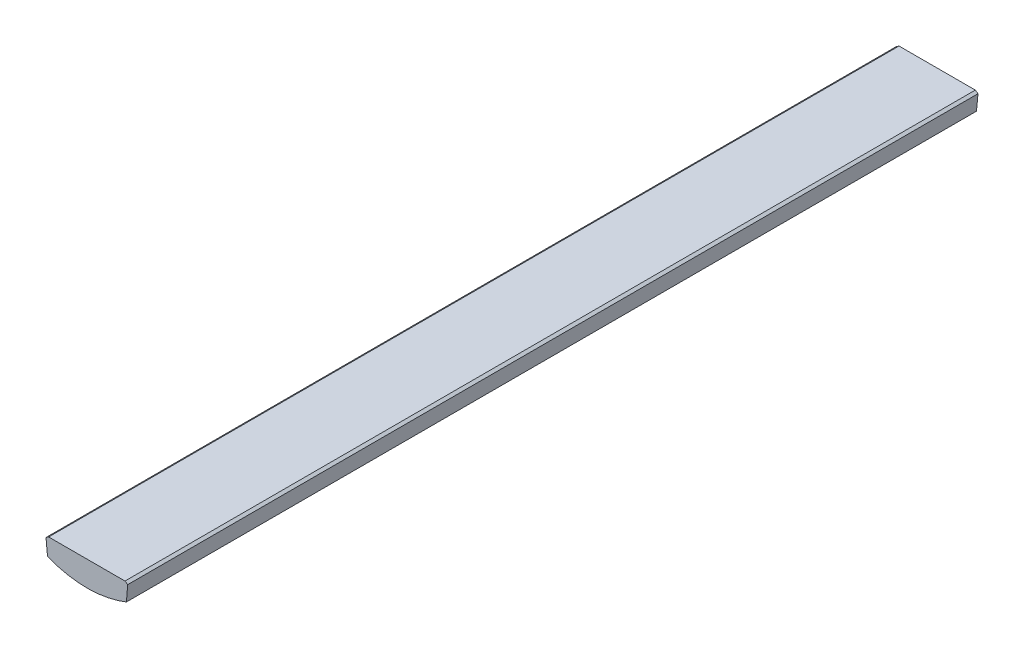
ISO-10303-21;
HEADER;
FILE_DESCRIPTION(('STEP AP214'),'2;1');
FILE_NAME('part.step','',(''),(''),'','','');
FILE_SCHEMA(('AUTOMOTIVE_DESIGN { 1 0 10303 214 1 1 1 1 }'));
ENDSEC;
DATA;
#1=APPLICATION_CONTEXT('core data for automotive mechanical design processes');
#2=APPLICATION_PROTOCOL_DEFINITION('international standard','automotive_design',2000,#1);
#3=PRODUCT_CONTEXT('',#1,'mechanical');
#4=PRODUCT('Part','Part','',(#3));
#5=PRODUCT_RELATED_PRODUCT_CATEGORY('part','',(#4));
#6=PRODUCT_DEFINITION_FORMATION('','',#4);
#7=PRODUCT_DEFINITION_CONTEXT('part definition',#1,'design');
#8=PRODUCT_DEFINITION('design','',#6,#7);
#9=PRODUCT_DEFINITION_SHAPE('','',#8);
#10=(LENGTH_UNIT() NAMED_UNIT(*) SI_UNIT(.MILLI.,.METRE.));
#11=(NAMED_UNIT(*) PLANE_ANGLE_UNIT() SI_UNIT($,.RADIAN.));
#12=(NAMED_UNIT(*) SI_UNIT($,.STERADIAN.) SOLID_ANGLE_UNIT());
#13=UNCERTAINTY_MEASURE_WITH_UNIT(LENGTH_MEASURE(1.E-05),#10,'distance_accuracy_value','');
#14=(GEOMETRIC_REPRESENTATION_CONTEXT(3) GLOBAL_UNCERTAINTY_ASSIGNED_CONTEXT((#13)) GLOBAL_UNIT_ASSIGNED_CONTEXT((#10,
#11,#12)) REPRESENTATION_CONTEXT('',''));
#15=CARTESIAN_POINT('',(0.,0.,0.));
#16=DIRECTION('',(0.,0.,1.));
#17=DIRECTION('',(1.,0.,0.));
#18=AXIS2_PLACEMENT_3D('',#15,#16,#17);
#19=CARTESIAN_POINT('',(-15.51625609,2.71949604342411E-13,186.04342008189));
#20=DIRECTION('',(0.,0.00872653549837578,-0.999961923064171));
#21=DIRECTION('',(-1.,0.,0.));
#22=AXIS2_PLACEMENT_3D('',#19,#20,#21);
#23=PLANE('',#22);
#24=DIRECTION('',(-0.830448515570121,-0.557074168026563,-0.00486151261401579));
#25=VECTOR('',#24,1.);
#26=CARTESIAN_POINT('',(-15.805216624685,-0.87758187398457,186.0357615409));
#27=LINE('',#26,#25);
#28=CARTESIAN_POINT('',(-14.49697688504,2.71949604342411E-13,186.04342008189));
#29=VERTEX_POINT('',#28);
#30=CARTESIAN_POINT('',(-15.51625609,-0.68374391,186.037453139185));
#31=VERTEX_POINT('',#30);
#32=EDGE_CURVE('E111',#29,#31,#27,.T.);
#33=ORIENTED_EDGE('',*,*,#32,.T.);
#34=DIRECTION('',(0.0871524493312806,-0.996157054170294,-0.00869333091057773));
#35=VECTOR('',#34,1.);
#36=CARTESIAN_POINT('',(-15.2707507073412,-3.48988327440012,186.012964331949));
#37=LINE('',#36,#35);
#38=CARTESIAN_POINT('',(-14.991795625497,-6.67835445,185.985138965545));
#39=VERTEX_POINT('',#38);
#40=EDGE_CURVE('E126',#31,#39,#37,.T.);
#41=ORIENTED_EDGE('',*,*,#40,.T.);
#42=CARTESIAN_POINT('',(-14.991795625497,-6.67835445,185.985138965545));
#43=CARTESIAN_POINT('',(-5.25356828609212,-10.6238388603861,185.950707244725));
#44=CARTESIAN_POINT('',(5.25356828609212,-10.6238388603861,185.950707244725));
#45=CARTESIAN_POINT('',(14.991795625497,-6.67835445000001,185.985138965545));
#46=(BOUNDED_CURVE() B_SPLINE_CURVE(3,(#42,#43,#44,#45),.UNSPECIFIED.,.F.,
.F.) B_SPLINE_CURVE_WITH_KNOTS((4,4),(2.75665085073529,3.5265344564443),
.UNSPECIFIED.) CURVE() GEOMETRIC_REPRESENTATION_ITEM() RATIONAL_B_SPLINE_CURVE((1.,
0.951213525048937,0.951213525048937,1.)) REPRESENTATION_ITEM(''));
#47=CARTESIAN_POINT('',(14.991795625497,-6.67835445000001,185.985138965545));
#48=VERTEX_POINT('',#47);
#49=EDGE_CURVE('E142',#39,#48,#46,.T.);
#50=ORIENTED_EDGE('',*,*,#49,.T.);
#51=DIRECTION('',(0.0871524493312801,0.996157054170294,0.00869333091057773));
#52=VECTOR('',#51,1.);
#53=CARTESIAN_POINT('',(15.2707507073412,-3.48988327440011,186.012964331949));
#54=LINE('',#53,#52);
#55=CARTESIAN_POINT('',(15.51625609,-0.683743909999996,186.037453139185));
#56=VERTEX_POINT('',#55);
#57=EDGE_CURVE('E152',#48,#56,#54,.T.);
#58=ORIENTED_EDGE('',*,*,#57,.T.);
#59=DIRECTION('',(-0.830448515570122,0.55707416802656,0.00486151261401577));
#60=VECTOR('',#59,1.);
#61=CARTESIAN_POINT('',(15.805216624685,-0.877581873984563,186.035761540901));
#62=LINE('',#61,#60);
#63=CARTESIAN_POINT('',(14.49697688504,3.117506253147E-13,186.04342008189));
#64=VERTEX_POINT('',#63);
#65=EDGE_CURVE('E108',#56,#64,#62,.T.);
#66=ORIENTED_EDGE('',*,*,#65,.T.);
#67=DIRECTION('',(-1.,0.,0.));
#68=VECTOR('',#67,1.);
#69=CARTESIAN_POINT('',(14.49697688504,0.,186.04342008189));
#70=LINE('',#69,#68);
#71=EDGE_CURVE('E26',#64,#29,#70,.T.);
#72=ORIENTED_EDGE('',*,*,#71,.T.);
#73=EDGE_LOOP('',(#33,#41,#50,#58,#66,#72));
#74=FACE_BOUND('',#73,.T.);
#75=ADVANCED_FACE('F16',(#74),#23,.F.);
#76=CARTESIAN_POINT('',(-15.51625609,3.11516330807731E-13,-137.04342008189));
#77=DIRECTION('',(0.,0.00872653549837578,0.999961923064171));
#78=DIRECTION('',(1.,0.,0.));
#79=AXIS2_PLACEMENT_3D('',#76,#77,#78);
#80=PLANE('',#79);
#81=DIRECTION('',(0.830448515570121,0.557074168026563,-0.00486151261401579));
#82=VECTOR('',#81,1.);
#83=CARTESIAN_POINT('',(-14.4931149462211,0.00259063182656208,-137.043442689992));
#84=LINE('',#83,#82);
#85=CARTESIAN_POINT('',(-15.51625609,-0.68374391,-137.037453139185));
#86=VERTEX_POINT('',#85);
#87=CARTESIAN_POINT('',(-14.49697688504,3.117506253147E-13,-137.04342008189));
#88=VERTEX_POINT('',#87);
#89=EDGE_CURVE('E101',#86,#88,#84,.T.);
#90=ORIENTED_EDGE('',*,*,#89,.T.);
#91=DIRECTION('',(1.,0.,0.));
#92=VECTOR('',#91,1.);
#93=CARTESIAN_POINT('',(14.49697688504,0.,-137.04342008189));
#94=LINE('',#93,#92);
#95=CARTESIAN_POINT('',(14.49697688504,3.11516330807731E-13,-137.04342008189));
#96=VERTEX_POINT('',#95);
#97=EDGE_CURVE('E10',#88,#96,#94,.T.);
#98=ORIENTED_EDGE('',*,*,#97,.T.);
#99=DIRECTION('',(0.830448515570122,-0.55707416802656,0.00486151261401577));
#100=VECTOR('',#99,1.);
#101=CARTESIAN_POINT('',(14.4931149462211,0.00259063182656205,-137.043442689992));
#102=LINE('',#101,#100);
#103=CARTESIAN_POINT('',(15.51625609,-0.683743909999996,-137.037453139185));
#104=VERTEX_POINT('',#103);
#105=EDGE_CURVE('E55',#96,#104,#102,.T.);
#106=ORIENTED_EDGE('',*,*,#105,.T.);
#107=DIRECTION('',(-0.0871524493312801,-0.996157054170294,0.00869333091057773));
#108=VECTOR('',#107,1.);
#109=CARTESIAN_POINT('',(15.516985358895,-0.675408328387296,-137.037525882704));
#110=LINE('',#109,#108);
#111=CARTESIAN_POINT('',(14.991795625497,-6.67835445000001,-136.985138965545));
#112=VERTEX_POINT('',#111);
#113=EDGE_CURVE('E144',#104,#112,#110,.T.);
#114=ORIENTED_EDGE('',*,*,#113,.T.);
#115=CARTESIAN_POINT('',(14.991795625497,-6.67835445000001,-136.985138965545));
#116=CARTESIAN_POINT('',(5.25356828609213,-10.6238388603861,-136.950707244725));
#117=CARTESIAN_POINT('',(-5.25356828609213,-10.6238388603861,-136.950707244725));
#118=CARTESIAN_POINT('',(-14.991795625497,-6.67835445,-136.985138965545));
#119=(BOUNDED_CURVE() B_SPLINE_CURVE(3,(#115,#116,#117,#118),.UNSPECIFIED.,.F.,
.F.) B_SPLINE_CURVE_WITH_KNOTS((4,4),(5.89824350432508,6.66812711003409),
.UNSPECIFIED.) CURVE() GEOMETRIC_REPRESENTATION_ITEM() RATIONAL_B_SPLINE_CURVE((1.,
0.951213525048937,0.951213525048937,1.)) REPRESENTATION_ITEM(''));
#120=CARTESIAN_POINT('',(-14.991795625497,-6.67835445,-136.985138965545));
#121=VERTEX_POINT('',#120);
#122=EDGE_CURVE('E68',#112,#121,#119,.T.);
#123=ORIENTED_EDGE('',*,*,#122,.T.);
#124=DIRECTION('',(-0.0871524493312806,0.996157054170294,-0.00869333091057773));
#125=VECTOR('',#124,1.);
#126=CARTESIAN_POINT('',(-15.516985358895,-0.6754083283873,-137.037525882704));
#127=LINE('',#126,#125);
#128=EDGE_CURVE('E103',#121,#86,#127,.T.);
#129=ORIENTED_EDGE('',*,*,#128,.T.);
#130=EDGE_LOOP('',(#90,#98,#106,#114,#123,#129));
#131=FACE_BOUND('',#130,.T.);
#132=ADVANCED_FACE('F102',(#131),#80,.F.);
#133=CARTESIAN_POINT('',(14.49697688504,0.,0.));
#134=DIRECTION('',(0.,1.,0.));
#135=DIRECTION('',(1.,0.,0.));
#136=AXIS2_PLACEMENT_3D('',#133,#134,#135);
#137=PLANE('',#136);
#138=ORIENTED_EDGE('',*,*,#71,.F.);
#139=DIRECTION('',(0.,0.,1.));
#140=VECTOR('',#139,1.);
#141=CARTESIAN_POINT('',(14.49697688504,3.117506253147E-13,-135.));
#142=LINE('',#141,#140);
#143=EDGE_CURVE('E99',#96,#64,#142,.T.);
#144=ORIENTED_EDGE('',*,*,#143,.F.);
#145=ORIENTED_EDGE('',*,*,#97,.F.);
#146=DIRECTION('',(0.,0.,1.));
#147=VECTOR('',#146,1.);
#148=CARTESIAN_POINT('',(-14.49697688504,3.117506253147E-13,-135.));
#149=LINE('',#148,#147);
#150=EDGE_CURVE('E19',#88,#29,#149,.T.);
#151=ORIENTED_EDGE('',*,*,#150,.T.);
#152=EDGE_LOOP('',(#138,#144,#145,#151));
#153=FACE_BOUND('',#152,.T.);
#154=ADVANCED_FACE('F95',(#153),#137,.T.);
#155=CARTESIAN_POINT('',(14.49697688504,3.117506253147E-13,-138.));
#156=DIRECTION('',(0.55708075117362,0.830458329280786,0.));
#157=DIRECTION('',(0.,0.,-1.));
#158=AXIS2_PLACEMENT_3D('',#155,#156,#157);
#159=PLANE('',#158);
#160=ORIENTED_EDGE('',*,*,#65,.F.);
#161=DIRECTION('',(0.,0.,1.));
#162=VECTOR('',#161,1.);
#163=CARTESIAN_POINT('',(15.51625609,-0.683743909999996,-138.));
#164=LINE('',#163,#162);
#165=EDGE_CURVE('E147',#104,#56,#164,.T.);
#166=ORIENTED_EDGE('',*,*,#165,.F.);
#167=ORIENTED_EDGE('',*,*,#105,.F.);
#168=ORIENTED_EDGE('',*,*,#143,.T.);
#169=EDGE_LOOP('',(#160,#166,#167,#168));
#170=FACE_BOUND('',#169,.T.);
#171=ADVANCED_FACE('F168',(#170),#159,.T.);
#172=CARTESIAN_POINT('',(-14.49697688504,3.117506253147E-13,-138.));
#173=DIRECTION('',(-0.557080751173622,0.830458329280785,0.));
#174=DIRECTION('',(0.,0.,1.));
#175=AXIS2_PLACEMENT_3D('',#172,#173,#174);
#176=PLANE('',#175);
#177=ORIENTED_EDGE('',*,*,#32,.F.);
#178=ORIENTED_EDGE('',*,*,#150,.F.);
#179=ORIENTED_EDGE('',*,*,#89,.F.);
#180=DIRECTION('',(0.,0.,1.));
#181=VECTOR('',#180,1.);
#182=CARTESIAN_POINT('',(-15.51625609,-0.68374391,-138.));
#183=LINE('',#182,#181);
#184=EDGE_CURVE('E122',#86,#31,#183,.T.);
#185=ORIENTED_EDGE('',*,*,#184,.T.);
#186=EDGE_LOOP('',(#177,#178,#179,#185));
#187=FACE_BOUND('',#186,.T.);
#188=ADVANCED_FACE('F110',(#187),#176,.T.);
#189=CARTESIAN_POINT('',(-15.51625609,-0.68374391,-138.));
#190=DIRECTION('',(-0.996194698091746,-0.0871557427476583,0.));
#191=DIRECTION('',(-0.0871557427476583,0.996194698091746,0.));
#192=AXIS2_PLACEMENT_3D('',#189,#190,#191);
#193=PLANE('',#192);
#194=ORIENTED_EDGE('',*,*,#40,.F.);
#195=ORIENTED_EDGE('',*,*,#184,.F.);
#196=ORIENTED_EDGE('',*,*,#128,.F.);
#197=DIRECTION('',(0.,0.,1.));
#198=VECTOR('',#197,1.);
#199=CARTESIAN_POINT('',(-14.991795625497,-6.67835445,-138.));
#200=LINE('',#199,#198);
#201=EDGE_CURVE('E132',#121,#39,#200,.T.);
#202=ORIENTED_EDGE('',*,*,#201,.T.);
#203=EDGE_LOOP('',(#194,#195,#196,#202));
#204=FACE_BOUND('',#203,.T.);
#205=ADVANCED_FACE('F181',(#204),#193,.T.);
#206=CARTESIAN_POINT('',(0.,30.3243298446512,-138.));
#207=DIRECTION('',(0.,0.,1.));
#208=DIRECTION('',(1.,0.,0.));
#209=AXIS2_PLACEMENT_3D('',#206,#207,#208);
#210=CYLINDRICAL_SURFACE('',#209,39.9243357);
#211=ORIENTED_EDGE('',*,*,#49,.F.);
#212=ORIENTED_EDGE('',*,*,#201,.F.);
#213=ORIENTED_EDGE('',*,*,#122,.F.);
#214=DIRECTION('',(0.,0.,1.));
#215=VECTOR('',#214,1.);
#216=CARTESIAN_POINT('',(14.991795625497,-6.67835445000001,-138.));
#217=LINE('',#216,#215);
#218=EDGE_CURVE('E148',#112,#48,#217,.T.);
#219=ORIENTED_EDGE('',*,*,#218,.T.);
#220=EDGE_LOOP('',(#211,#212,#213,#219));
#221=FACE_BOUND('',#220,.T.);
#222=ADVANCED_FACE('F178',(#221),#210,.T.);
#223=CARTESIAN_POINT('',(15.51625609,-0.683743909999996,-138.));
#224=DIRECTION('',(0.996194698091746,-0.0871557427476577,0.));
#225=DIRECTION('',(0.,0.,-1.));
#226=AXIS2_PLACEMENT_3D('',#223,#224,#225);
#227=PLANE('',#226);
#228=ORIENTED_EDGE('',*,*,#57,.F.);
#229=ORIENTED_EDGE('',*,*,#218,.F.);
#230=ORIENTED_EDGE('',*,*,#113,.F.);
#231=ORIENTED_EDGE('',*,*,#165,.T.);
#232=EDGE_LOOP('',(#228,#229,#230,#231));
#233=FACE_BOUND('',#232,.T.);
#234=ADVANCED_FACE('F176',(#233),#227,.T.);
#235=CLOSED_SHELL('',(#75,#132,#154,#171,#188,#205,#222,#234));
#236=MANIFOLD_SOLID_BREP('B1',#235);
#237=ADVANCED_BREP_SHAPE_REPRESENTATION('',(#18,#236),#14);
#238=SHAPE_DEFINITION_REPRESENTATION(#9,#237);
ENDSEC;
END-ISO-10303-21;
